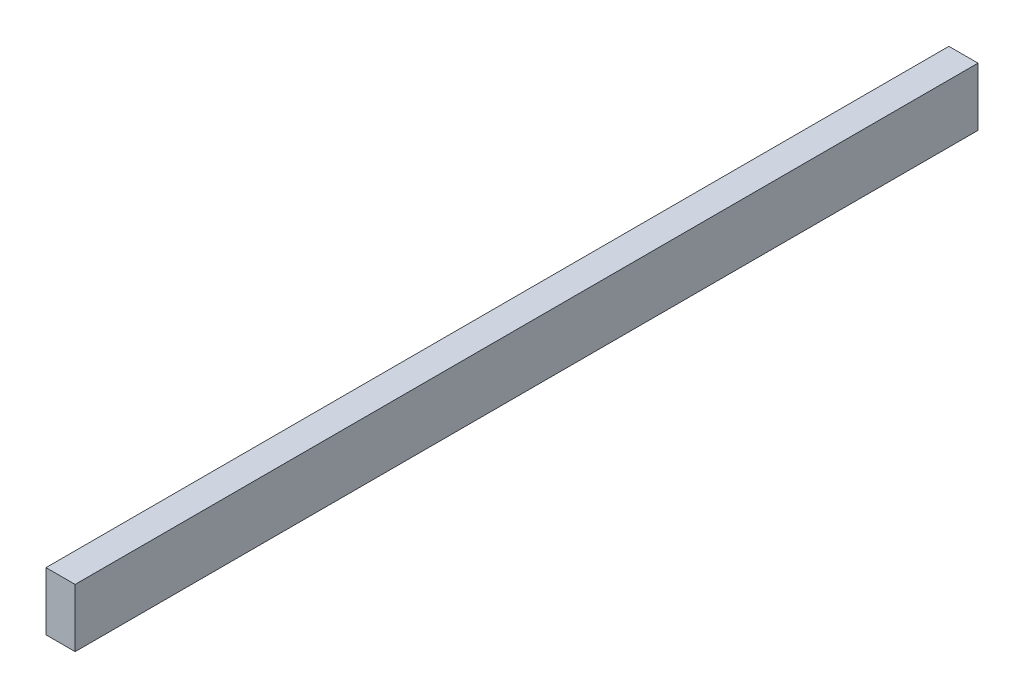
from build123d import *

# Parameters (mm, degrees)
ESQUISSE1_W      = 15
ESQUISSE1_H      = 30
EXTRUSION1_DEPTH = 465


with BuildPart() as part:
    # Esquisse1 → Extrusion1 (new body)
    with BuildSketch(Plane.XY):
        with Locations((7.5, 15)):
            Rectangle(ESQUISSE1_W, ESQUISSE1_H)
    extrude(amount=EXTRUSION1_DEPTH)


solid = part.part
